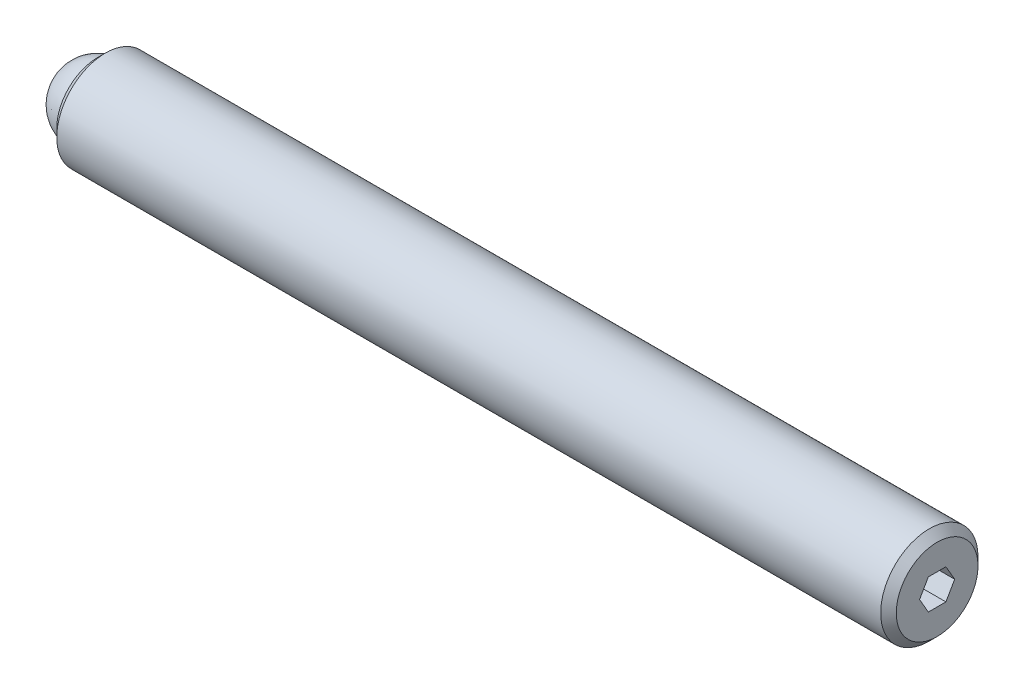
ISO-10303-21;
HEADER;
FILE_DESCRIPTION(('STEP AP214'),'2;1');
FILE_NAME('part.step','',(''),(''),'','','');
FILE_SCHEMA(('AUTOMOTIVE_DESIGN { 1 0 10303 214 1 1 1 1 }'));
ENDSEC;
DATA;
#1=APPLICATION_CONTEXT('core data for automotive mechanical design processes');
#2=APPLICATION_PROTOCOL_DEFINITION('international standard','automotive_design',2000,#1);
#3=PRODUCT_CONTEXT('',#1,'mechanical');
#4=PRODUCT('Part','Part','',(#3));
#5=PRODUCT_RELATED_PRODUCT_CATEGORY('part','',(#4));
#6=PRODUCT_DEFINITION_FORMATION('','',#4);
#7=PRODUCT_DEFINITION_CONTEXT('part definition',#1,'design');
#8=PRODUCT_DEFINITION('design','',#6,#7);
#9=PRODUCT_DEFINITION_SHAPE('','',#8);
#10=(LENGTH_UNIT() NAMED_UNIT(*) SI_UNIT(.MILLI.,.METRE.));
#11=(NAMED_UNIT(*) PLANE_ANGLE_UNIT() SI_UNIT($,.RADIAN.));
#12=(NAMED_UNIT(*) SI_UNIT($,.STERADIAN.) SOLID_ANGLE_UNIT());
#13=UNCERTAINTY_MEASURE_WITH_UNIT(LENGTH_MEASURE(1.E-05),#10,'distance_accuracy_value','');
#14=(GEOMETRIC_REPRESENTATION_CONTEXT(3) GLOBAL_UNCERTAINTY_ASSIGNED_CONTEXT((#13)) GLOBAL_UNIT_ASSIGNED_CONTEXT((#10,
#11,#12)) REPRESENTATION_CONTEXT('',''));
#15=CARTESIAN_POINT('',(0.,0.,0.));
#16=DIRECTION('',(0.,0.,1.));
#17=DIRECTION('',(1.,0.,0.));
#18=AXIS2_PLACEMENT_3D('',#15,#16,#17);
#19=CARTESIAN_POINT('',(0.,0.,0.));
#20=DIRECTION('',(0.,-1.,0.));
#21=DIRECTION('',(0.,0.,1.));
#22=AXIS2_PLACEMENT_3D('',#19,#20,#21);
#23=SPHERICAL_SURFACE('',#22,2.38125);
#24=CARTESIAN_POINT('',(0.,-2.38125,0.));
#25=VERTEX_POINT('',#24);
#26=VERTEX_LOOP('',#25);
#27=FACE_BOUND('',#26,.T.);
#28=ADVANCED_FACE('F43',(#27),#23,.T.);
#29=CLOSED_SHELL('',(#28));
#30=MANIFOLD_SOLID_BREP('B2',#29);
#31=CARTESIAN_POINT('',(54.76875,0.,0.));
#32=DIRECTION('',(-1.,0.,0.));
#33=DIRECTION('',(0.,0.,1.));
#34=AXIS2_PLACEMENT_3D('',#31,#32,#33);
#35=CYLINDRICAL_SURFACE('',#34,3.175);
#36=CARTESIAN_POINT('',(54.26075,0.,0.));
#37=DIRECTION('',(1.,0.,0.));
#38=DIRECTION('',(0.,0.,-1.));
#39=AXIS2_PLACEMENT_3D('',#36,#37,#38);
#40=CIRCLE('',#39,3.175);
#41=CARTESIAN_POINT('',(54.26075,0.,-3.175));
#42=VERTEX_POINT('',#41);
#43=EDGE_CURVE('E41',#42,#42,#40,.F.);
#44=ORIENTED_EDGE('',*,*,#43,.T.);
#45=EDGE_LOOP('',(#44));
#46=FACE_BOUND('',#45,.T.);
#47=CARTESIAN_POINT('',(0.508000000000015,0.,0.));
#48=DIRECTION('',(1.,0.,0.));
#49=DIRECTION('',(0.,0.,-1.));
#50=AXIS2_PLACEMENT_3D('',#47,#48,#49);
#51=CIRCLE('',#50,3.175);
#52=CARTESIAN_POINT('',(0.508000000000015,0.,-3.175));
#53=VERTEX_POINT('',#52);
#54=EDGE_CURVE('E159',#53,#53,#51,.T.);
#55=ORIENTED_EDGE('',*,*,#54,.T.);
#56=EDGE_LOOP('',(#55));
#57=FACE_BOUND('',#56,.T.);
#58=ADVANCED_FACE('F56',(#46,#57),#35,.T.);
#59=CARTESIAN_POINT('',(54.76875,0.,0.));
#60=DIRECTION('',(1.,0.,0.));
#61=DIRECTION('',(0.,0.,-1.));
#62=AXIS2_PLACEMENT_3D('',#59,#60,#61);
#63=PLANE('',#62);
#64=DIRECTION('',(0.,0.866025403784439,-0.5));
#65=VECTOR('',#64,1.);
#66=CARTESIAN_POINT('',(54.76875,-0.9921875,-0.572839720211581));
#67=LINE('',#66,#65);
#68=CARTESIAN_POINT('',(54.76875,-0.9921875,-0.572839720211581));
#69=VERTEX_POINT('',#68);
#70=CARTESIAN_POINT('',(54.76875,0.,-1.14567944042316));
#71=VERTEX_POINT('',#70);
#72=EDGE_CURVE('E71',#69,#71,#67,.T.);
#73=ORIENTED_EDGE('',*,*,#72,.F.);
#74=DIRECTION('',(0.,0.,-1.));
#75=VECTOR('',#74,1.);
#76=CARTESIAN_POINT('',(54.76875,-0.9921875,0.572839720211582));
#77=LINE('',#76,#75);
#78=CARTESIAN_POINT('',(54.76875,-0.9921875,0.572839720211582));
#79=VERTEX_POINT('',#78);
#80=EDGE_CURVE('E155',#79,#69,#77,.T.);
#81=ORIENTED_EDGE('',*,*,#80,.F.);
#82=DIRECTION('',(0.,-0.866025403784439,-0.5));
#83=VECTOR('',#82,1.);
#84=CARTESIAN_POINT('',(54.76875,0.,1.14567944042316));
#85=LINE('',#84,#83);
#86=CARTESIAN_POINT('',(54.76875,0.,1.14567944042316));
#87=VERTEX_POINT('',#86);
#88=EDGE_CURVE('E153',#87,#79,#85,.T.);
#89=ORIENTED_EDGE('',*,*,#88,.F.);
#90=DIRECTION('',(0.,-0.866025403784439,0.5));
#91=VECTOR('',#90,1.);
#92=CARTESIAN_POINT('',(54.76875,0.992187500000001,0.572839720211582));
#93=LINE('',#92,#91);
#94=CARTESIAN_POINT('',(54.76875,0.992187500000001,0.572839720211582));
#95=VERTEX_POINT('',#94);
#96=EDGE_CURVE('E119',#95,#87,#93,.T.);
#97=ORIENTED_EDGE('',*,*,#96,.F.);
#98=DIRECTION('',(0.,0.,1.));
#99=VECTOR('',#98,1.);
#100=CARTESIAN_POINT('',(54.76875,0.9921875,-0.572839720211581));
#101=LINE('',#100,#99);
#102=CARTESIAN_POINT('',(54.76875,0.9921875,-0.572839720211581));
#103=VERTEX_POINT('',#102);
#104=EDGE_CURVE('E149',#103,#95,#101,.T.);
#105=ORIENTED_EDGE('',*,*,#104,.F.);
#106=DIRECTION('',(0.,0.866025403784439,0.5));
#107=VECTOR('',#106,1.);
#108=CARTESIAN_POINT('',(54.76875,0.,-1.14567944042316));
#109=LINE('',#108,#107);
#110=EDGE_CURVE('E145',#71,#103,#109,.T.);
#111=ORIENTED_EDGE('',*,*,#110,.F.);
#112=EDGE_LOOP('',(#73,#81,#89,#97,#105,#111));
#113=FACE_BOUND('',#112,.T.);
#114=CARTESIAN_POINT('',(54.76875,0.,0.));
#115=DIRECTION('',(1.,0.,0.));
#116=DIRECTION('',(0.,0.,-1.));
#117=AXIS2_PLACEMENT_3D('',#114,#115,#116);
#118=CIRCLE('',#117,2.667);
#119=CARTESIAN_POINT('',(54.76875,0.,-2.667));
#120=VERTEX_POINT('',#119);
#121=EDGE_CURVE('E64',#120,#120,#118,.T.);
#122=ORIENTED_EDGE('',*,*,#121,.T.);
#123=EDGE_LOOP('',(#122));
#124=FACE_BOUND('',#123,.T.);
#125=ADVANCED_FACE('F172',(#113,#124),#63,.T.);
#126=CARTESIAN_POINT('',(0.,0.,0.));
#127=DIRECTION('',(1.,0.,0.));
#128=DIRECTION('',(0.,0.,-1.));
#129=AXIS2_PLACEMENT_3D('',#126,#127,#128);
#130=PLANE('',#129);
#131=CARTESIAN_POINT('',(0.,0.,0.));
#132=DIRECTION('',(-1.,0.,0.));
#133=DIRECTION('',(0.,0.,1.));
#134=AXIS2_PLACEMENT_3D('',#131,#132,#133);
#135=CIRCLE('',#134,2.38125);
#136=CARTESIAN_POINT('',(0.,0.,2.38125));
#137=VERTEX_POINT('',#136);
#138=EDGE_CURVE('E227',#137,#137,#135,.T.);
#139=ORIENTED_EDGE('',*,*,#138,.F.);
#140=EDGE_LOOP('',(#139));
#141=FACE_BOUND('',#140,.T.);
#142=CARTESIAN_POINT('',(0.,0.,0.));
#143=DIRECTION('',(1.,0.,0.));
#144=DIRECTION('',(0.,0.,-1.));
#145=AXIS2_PLACEMENT_3D('',#142,#143,#144);
#146=CIRCLE('',#145,2.66699999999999);
#147=CARTESIAN_POINT('',(0.,0.,-2.66699999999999));
#148=VERTEX_POINT('',#147);
#149=EDGE_CURVE('E167',#148,#148,#146,.F.);
#150=ORIENTED_EDGE('',*,*,#149,.T.);
#151=EDGE_LOOP('',(#150));
#152=FACE_BOUND('',#151,.T.);
#153=ADVANCED_FACE('F184',(#141,#152),#130,.F.);
#154=CARTESIAN_POINT('',(0.508000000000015,0.,0.));
#155=DIRECTION('',(1.,0.,0.));
#156=DIRECTION('',(0.,0.,-1.));
#157=AXIS2_PLACEMENT_3D('',#154,#155,#156);
#158=CONICAL_SURFACE('',#157,3.175,0.785398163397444);
#159=ORIENTED_EDGE('',*,*,#149,.F.);
#160=EDGE_LOOP('',(#159));
#161=FACE_BOUND('',#160,.T.);
#162=ORIENTED_EDGE('',*,*,#54,.F.);
#163=EDGE_LOOP('',(#162));
#164=FACE_BOUND('',#163,.T.);
#165=ADVANCED_FACE('F176',(#161,#164),#158,.T.);
#166=CARTESIAN_POINT('',(54.76875,0.,0.));
#167=DIRECTION('',(-1.,0.,0.));
#168=DIRECTION('',(0.,0.,1.));
#169=AXIS2_PLACEMENT_3D('',#166,#167,#168);
#170=CONICAL_SURFACE('',#169,2.667,0.785398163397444);
#171=ORIENTED_EDGE('',*,*,#43,.F.);
#172=EDGE_LOOP('',(#171));
#173=FACE_BOUND('',#172,.T.);
#174=ORIENTED_EDGE('',*,*,#121,.F.);
#175=EDGE_LOOP('',(#174));
#176=FACE_BOUND('',#175,.T.);
#177=ADVANCED_FACE('F58',(#173,#176),#170,.T.);
#178=CARTESIAN_POINT('',(52.48275,-0.9921875,-0.572839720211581));
#179=DIRECTION('',(0.,-0.5,-0.866025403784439));
#180=DIRECTION('',(0.,0.866025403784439,-0.5));
#181=AXIS2_PLACEMENT_3D('',#178,#179,#180);
#182=PLANE('',#181);
#183=ORIENTED_EDGE('',*,*,#72,.T.);
#184=DIRECTION('',(1.,0.,0.));
#185=VECTOR('',#184,1.);
#186=CARTESIAN_POINT('',(52.48275,0.,-1.14567944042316));
#187=LINE('',#186,#185);
#188=CARTESIAN_POINT('',(52.48275,0.,-1.14567944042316));
#189=VERTEX_POINT('',#188);
#190=EDGE_CURVE('E101',#189,#71,#187,.T.);
#191=ORIENTED_EDGE('',*,*,#190,.F.);
#192=DIRECTION('',(0.,0.866025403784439,-0.5));
#193=VECTOR('',#192,1.);
#194=CARTESIAN_POINT('',(52.48275,-0.9921875,-0.572839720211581));
#195=LINE('',#194,#193);
#196=CARTESIAN_POINT('',(52.48275,-0.9921875,-0.572839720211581));
#197=VERTEX_POINT('',#196);
#198=EDGE_CURVE('E157',#197,#189,#195,.T.);
#199=ORIENTED_EDGE('',*,*,#198,.F.);
#200=DIRECTION('',(1.,0.,0.));
#201=VECTOR('',#200,1.);
#202=CARTESIAN_POINT('',(52.48275,-0.9921875,-0.572839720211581));
#203=LINE('',#202,#201);
#204=EDGE_CURVE('E79',#197,#69,#203,.T.);
#205=ORIENTED_EDGE('',*,*,#204,.T.);
#206=EDGE_LOOP('',(#183,#191,#199,#205));
#207=FACE_BOUND('',#206,.T.);
#208=ADVANCED_FACE('F175',(#207),#182,.F.);
#209=CARTESIAN_POINT('',(52.48275,-0.9921875,0.572839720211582));
#210=DIRECTION('',(0.,-1.,0.));
#211=DIRECTION('',(0.,0.,-1.));
#212=AXIS2_PLACEMENT_3D('',#209,#210,#211);
#213=PLANE('',#212);
#214=ORIENTED_EDGE('',*,*,#80,.T.);
#215=ORIENTED_EDGE('',*,*,#204,.F.);
#216=DIRECTION('',(0.,0.,-1.));
#217=VECTOR('',#216,1.);
#218=CARTESIAN_POINT('',(52.48275,-0.9921875,0.572839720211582));
#219=LINE('',#218,#217);
#220=CARTESIAN_POINT('',(52.48275,-0.9921875,0.572839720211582));
#221=VERTEX_POINT('',#220);
#222=EDGE_CURVE('E131',#221,#197,#219,.T.);
#223=ORIENTED_EDGE('',*,*,#222,.F.);
#224=DIRECTION('',(1.,0.,0.));
#225=VECTOR('',#224,1.);
#226=CARTESIAN_POINT('',(52.48275,-0.9921875,0.572839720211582));
#227=LINE('',#226,#225);
#228=EDGE_CURVE('E123',#221,#79,#227,.T.);
#229=ORIENTED_EDGE('',*,*,#228,.T.);
#230=EDGE_LOOP('',(#214,#215,#223,#229));
#231=FACE_BOUND('',#230,.T.);
#232=ADVANCED_FACE('F182',(#231),#213,.F.);
#233=CARTESIAN_POINT('',(52.48275,0.,1.14567944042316));
#234=DIRECTION('',(0.,-0.5,0.866025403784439));
#235=DIRECTION('',(0.,-0.866025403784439,-0.5));
#236=AXIS2_PLACEMENT_3D('',#233,#234,#235);
#237=PLANE('',#236);
#238=ORIENTED_EDGE('',*,*,#88,.T.);
#239=ORIENTED_EDGE('',*,*,#228,.F.);
#240=DIRECTION('',(0.,-0.866025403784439,-0.5));
#241=VECTOR('',#240,1.);
#242=CARTESIAN_POINT('',(52.48275,0.,1.14567944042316));
#243=LINE('',#242,#241);
#244=CARTESIAN_POINT('',(52.48275,0.,1.14567944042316));
#245=VERTEX_POINT('',#244);
#246=EDGE_CURVE('E127',#245,#221,#243,.T.);
#247=ORIENTED_EDGE('',*,*,#246,.F.);
#248=DIRECTION('',(1.,0.,0.));
#249=VECTOR('',#248,1.);
#250=CARTESIAN_POINT('',(52.48275,0.,1.14567944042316));
#251=LINE('',#250,#249);
#252=EDGE_CURVE('E112',#245,#87,#251,.T.);
#253=ORIENTED_EDGE('',*,*,#252,.T.);
#254=EDGE_LOOP('',(#238,#239,#247,#253));
#255=FACE_BOUND('',#254,.T.);
#256=ADVANCED_FACE('F128',(#255),#237,.F.);
#257=CARTESIAN_POINT('',(52.48275,0.992187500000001,0.572839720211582));
#258=DIRECTION('',(0.,0.5,0.866025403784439));
#259=DIRECTION('',(0.,-0.866025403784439,0.5));
#260=AXIS2_PLACEMENT_3D('',#257,#258,#259);
#261=PLANE('',#260);
#262=ORIENTED_EDGE('',*,*,#96,.T.);
#263=ORIENTED_EDGE('',*,*,#252,.F.);
#264=DIRECTION('',(0.,-0.866025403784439,0.5));
#265=VECTOR('',#264,1.);
#266=CARTESIAN_POINT('',(52.48275,0.992187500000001,0.572839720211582));
#267=LINE('',#266,#265);
#268=CARTESIAN_POINT('',(52.48275,0.992187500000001,0.572839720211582));
#269=VERTEX_POINT('',#268);
#270=EDGE_CURVE('E116',#269,#245,#267,.T.);
#271=ORIENTED_EDGE('',*,*,#270,.F.);
#272=DIRECTION('',(1.,0.,0.));
#273=VECTOR('',#272,1.);
#274=CARTESIAN_POINT('',(52.48275,0.992187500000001,0.572839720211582));
#275=LINE('',#274,#273);
#276=EDGE_CURVE('E124',#269,#95,#275,.T.);
#277=ORIENTED_EDGE('',*,*,#276,.T.);
#278=EDGE_LOOP('',(#262,#263,#271,#277));
#279=FACE_BOUND('',#278,.T.);
#280=ADVANCED_FACE('F114',(#279),#261,.F.);
#281=CARTESIAN_POINT('',(52.48275,0.9921875,-0.572839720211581));
#282=DIRECTION('',(0.,1.,0.));
#283=DIRECTION('',(0.,0.,1.));
#284=AXIS2_PLACEMENT_3D('',#281,#282,#283);
#285=PLANE('',#284);
#286=ORIENTED_EDGE('',*,*,#104,.T.);
#287=ORIENTED_EDGE('',*,*,#276,.F.);
#288=DIRECTION('',(0.,0.,1.));
#289=VECTOR('',#288,1.);
#290=CARTESIAN_POINT('',(52.48275,0.9921875,-0.572839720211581));
#291=LINE('',#290,#289);
#292=CARTESIAN_POINT('',(52.48275,0.9921875,-0.572839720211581));
#293=VERTEX_POINT('',#292);
#294=EDGE_CURVE('E137',#293,#269,#291,.T.);
#295=ORIENTED_EDGE('',*,*,#294,.F.);
#296=DIRECTION('',(1.,0.,0.));
#297=VECTOR('',#296,1.);
#298=CARTESIAN_POINT('',(52.48275,0.9921875,-0.572839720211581));
#299=LINE('',#298,#297);
#300=EDGE_CURVE('E162',#293,#103,#299,.T.);
#301=ORIENTED_EDGE('',*,*,#300,.T.);
#302=EDGE_LOOP('',(#286,#287,#295,#301));
#303=FACE_BOUND('',#302,.T.);
#304=ADVANCED_FACE('F203',(#303),#285,.F.);
#305=CARTESIAN_POINT('',(52.48275,0.,-1.14567944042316));
#306=DIRECTION('',(0.,0.5,-0.866025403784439));
#307=DIRECTION('',(0.,0.866025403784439,0.5));
#308=AXIS2_PLACEMENT_3D('',#305,#306,#307);
#309=PLANE('',#308);
#310=ORIENTED_EDGE('',*,*,#110,.T.);
#311=ORIENTED_EDGE('',*,*,#300,.F.);
#312=DIRECTION('',(0.,0.866025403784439,0.5));
#313=VECTOR('',#312,1.);
#314=CARTESIAN_POINT('',(52.48275,0.,-1.14567944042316));
#315=LINE('',#314,#313);
#316=EDGE_CURVE('E139',#189,#293,#315,.T.);
#317=ORIENTED_EDGE('',*,*,#316,.F.);
#318=ORIENTED_EDGE('',*,*,#190,.T.);
#319=EDGE_LOOP('',(#310,#311,#317,#318));
#320=FACE_BOUND('',#319,.T.);
#321=ADVANCED_FACE('F200',(#320),#309,.F.);
#322=CARTESIAN_POINT('',(52.48275,0.,0.));
#323=DIRECTION('',(1.,0.,0.));
#324=DIRECTION('',(0.,0.,-1.));
#325=AXIS2_PLACEMENT_3D('',#322,#323,#324);
#326=PLANE('',#325);
#327=ORIENTED_EDGE('',*,*,#198,.T.);
#328=ORIENTED_EDGE('',*,*,#316,.T.);
#329=ORIENTED_EDGE('',*,*,#294,.T.);
#330=ORIENTED_EDGE('',*,*,#270,.T.);
#331=ORIENTED_EDGE('',*,*,#246,.T.);
#332=ORIENTED_EDGE('',*,*,#222,.T.);
#333=EDGE_LOOP('',(#327,#328,#329,#330,#331,#332));
#334=FACE_BOUND('',#333,.T.);
#335=ADVANCED_FACE('F134',(#334),#326,.T.);
#336=CARTESIAN_POINT('',(1.984375,0.,0.));
#337=DIRECTION('',(-1.,0.,0.));
#338=DIRECTION('',(0.,0.,1.));
#339=AXIS2_PLACEMENT_3D('',#336,#337,#338);
#340=CYLINDRICAL_SURFACE('',#339,2.38125);
#341=CARTESIAN_POINT('',(1.984375,0.,0.));
#342=DIRECTION('',(-1.,0.,0.));
#343=DIRECTION('',(0.,0.,1.));
#344=AXIS2_PLACEMENT_3D('',#341,#342,#343);
#345=CIRCLE('',#344,2.38125);
#346=CARTESIAN_POINT('',(1.984375,0.,2.38125));
#347=VERTEX_POINT('',#346);
#348=EDGE_CURVE('E146',#347,#347,#345,.T.);
#349=ORIENTED_EDGE('',*,*,#348,.F.);
#350=EDGE_LOOP('',(#349));
#351=FACE_BOUND('',#350,.T.);
#352=ORIENTED_EDGE('',*,*,#138,.T.);
#353=EDGE_LOOP('',(#352));
#354=FACE_BOUND('',#353,.T.);
#355=ADVANCED_FACE('F216',(#351,#354),#340,.F.);
#356=CARTESIAN_POINT('',(1.984375,0.,0.));
#357=DIRECTION('',(-1.,0.,0.));
#358=DIRECTION('',(0.,0.,1.));
#359=AXIS2_PLACEMENT_3D('',#356,#357,#358);
#360=PLANE('',#359);
#361=ORIENTED_EDGE('',*,*,#348,.T.);
#362=EDGE_LOOP('',(#361));
#363=FACE_BOUND('',#362,.T.);
#364=ADVANCED_FACE('F219',(#363),#360,.T.);
#365=CLOSED_SHELL('',(#58,#125,#153,#165,#177,#208,#232,#256,#280,#304,#321,#335,#355,#364));
#366=MANIFOLD_SOLID_BREP('B6',#365);
#367=ADVANCED_BREP_SHAPE_REPRESENTATION('',(#18,#30,#366),#14);
#368=SHAPE_DEFINITION_REPRESENTATION(#9,#367);
ENDSEC;
END-ISO-10303-21;
